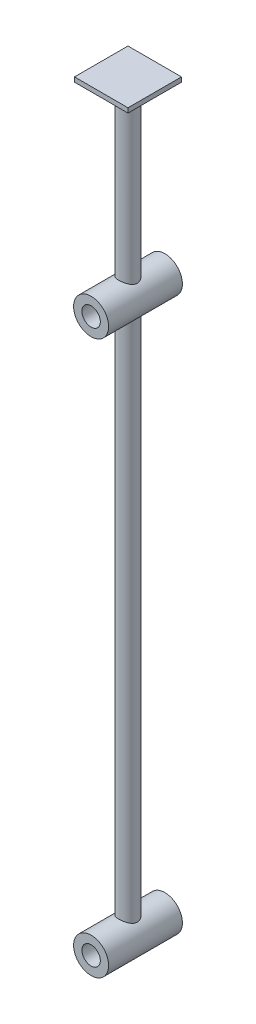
ISO-10303-21;
HEADER;
FILE_DESCRIPTION(('STEP AP214'),'2;1');
FILE_NAME('part.step','',(''),(''),'','','');
FILE_SCHEMA(('AUTOMOTIVE_DESIGN { 1 0 10303 214 1 1 1 1 }'));
ENDSEC;
DATA;
#1=APPLICATION_CONTEXT('core data for automotive mechanical design processes');
#2=APPLICATION_PROTOCOL_DEFINITION('international standard','automotive_design',2000,#1);
#3=PRODUCT_CONTEXT('',#1,'mechanical');
#4=PRODUCT('Part','Part','',(#3));
#5=PRODUCT_RELATED_PRODUCT_CATEGORY('part','',(#4));
#6=PRODUCT_DEFINITION_FORMATION('','',#4);
#7=PRODUCT_DEFINITION_CONTEXT('part definition',#1,'design');
#8=PRODUCT_DEFINITION('design','',#6,#7);
#9=PRODUCT_DEFINITION_SHAPE('','',#8);
#10=(LENGTH_UNIT() NAMED_UNIT(*) SI_UNIT(.MILLI.,.METRE.));
#11=(NAMED_UNIT(*) PLANE_ANGLE_UNIT() SI_UNIT($,.RADIAN.));
#12=(NAMED_UNIT(*) SI_UNIT($,.STERADIAN.) SOLID_ANGLE_UNIT());
#13=UNCERTAINTY_MEASURE_WITH_UNIT(LENGTH_MEASURE(1.E-05),#10,'distance_accuracy_value','');
#14=(GEOMETRIC_REPRESENTATION_CONTEXT(3) GLOBAL_UNCERTAINTY_ASSIGNED_CONTEXT((#13)) GLOBAL_UNIT_ASSIGNED_CONTEXT((#10,
#11,#12)) REPRESENTATION_CONTEXT('',''));
#15=CARTESIAN_POINT('',(0.,0.,0.));
#16=DIRECTION('',(0.,0.,1.));
#17=DIRECTION('',(1.,0.,0.));
#18=AXIS2_PLACEMENT_3D('',#15,#16,#17);
#19=CARTESIAN_POINT('',(0.,0.,40.));
#20=DIRECTION('',(0.,0.,-1.));
#21=DIRECTION('',(-1.,0.,0.));
#22=AXIS2_PLACEMENT_3D('',#19,#20,#21);
#23=CYLINDRICAL_SURFACE('',#22,19.);
#24=CARTESIAN_POINT('',(0.,0.,-40.));
#25=DIRECTION('',(0.,0.,1.));
#26=DIRECTION('',(1.,0.,0.));
#27=AXIS2_PLACEMENT_3D('',#24,#25,#26);
#28=CIRCLE('',#27,19.);
#29=CARTESIAN_POINT('',(19.,0.,-40.));
#30=VERTEX_POINT('',#29);
#31=EDGE_CURVE('E199',#30,#30,#28,.T.);
#32=ORIENTED_EDGE('',*,*,#31,.T.);
#33=EDGE_LOOP('',(#32));
#34=FACE_BOUND('',#33,.T.);
#35=CARTESIAN_POINT('',(0.,0.,40.));
#36=DIRECTION('',(0.,0.,1.));
#37=DIRECTION('',(1.,0.,0.));
#38=AXIS2_PLACEMENT_3D('',#35,#36,#37);
#39=CIRCLE('',#38,19.);
#40=CARTESIAN_POINT('',(19.,0.,40.));
#41=VERTEX_POINT('',#40);
#42=EDGE_CURVE('E203',#41,#41,#39,.T.);
#43=ORIENTED_EDGE('',*,*,#42,.F.);
#44=EDGE_LOOP('',(#43));
#45=FACE_BOUND('',#44,.T.);
#46=CARTESIAN_POINT('',(0.,19.,-10.));
#47=CARTESIAN_POINT('',(-0.261284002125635,19.0000005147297,-10.0000006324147));
#48=CARTESIAN_POINT('',(-0.522560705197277,18.9945987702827,-9.9897489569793));
#49=CARTESIAN_POINT('',(-1.04316816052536,18.9731308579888,-9.94886917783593));
#50=CARTESIAN_POINT('',(-1.30249817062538,18.957060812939,-9.91823366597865));
#51=CARTESIAN_POINT('',(-1.81751271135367,18.9146374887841,-9.8369057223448));
#52=CARTESIAN_POINT('',(-2.07319149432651,18.8882695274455,-9.78618465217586));
#53=CARTESIAN_POINT('',(-2.57867692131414,18.8259203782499,-9.66529653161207));
#54=CARTESIAN_POINT('',(-2.82848403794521,18.7899399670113,-9.59513105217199));
#55=CARTESIAN_POINT('',(-3.31961543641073,18.7094050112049,-9.43644465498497));
#56=CARTESIAN_POINT('',(-3.56096999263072,18.6648858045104,-9.34799927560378));
#57=CARTESIAN_POINT('',(-4.03485602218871,18.5682100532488,-9.15344464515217));
#58=CARTESIAN_POINT('',(-4.26738734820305,18.5160533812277,-9.04733509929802));
#59=CARTESIAN_POINT('',(-4.72235633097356,18.4052752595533,-8.81840050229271));
#60=CARTESIAN_POINT('',(-4.94479706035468,18.3466557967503,-8.69558058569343));
#61=CARTESIAN_POINT('',(-5.37873126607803,18.2241626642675,-8.43406514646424));
#62=CARTESIAN_POINT('',(-5.59022036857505,18.1602869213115,-8.29536335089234));
#63=CARTESIAN_POINT('',(-6.01460634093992,18.024353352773,-7.99353665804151));
#64=CARTESIAN_POINT('',(-6.22670849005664,17.9520335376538,-7.82941208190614));
#65=CARTESIAN_POINT('',(-6.63651342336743,17.804609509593,-7.48520583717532));
#66=CARTESIAN_POINT('',(-6.83421528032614,17.7295051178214,-7.305123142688));
#67=CARTESIAN_POINT('',(-7.21451054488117,17.5781895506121,-6.92980933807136));
#68=CARTESIAN_POINT('',(-7.39709330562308,17.5019776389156,-6.73456773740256));
#69=CARTESIAN_POINT('',(-7.74621354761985,17.3502856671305,-6.32989771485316));
#70=CARTESIAN_POINT('',(-7.91274787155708,17.2748057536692,-6.12046651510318));
#71=CARTESIAN_POINT('',(-8.24291049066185,17.1198877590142,-5.66915875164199));
#72=CARTESIAN_POINT('',(-8.40497498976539,17.0406912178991,-5.42605141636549));
#73=CARTESIAN_POINT('',(-8.70782467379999,16.8879410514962,-4.92537784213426));
#74=CARTESIAN_POINT('',(-8.84861889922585,16.8143850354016,-4.6678178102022));
#75=CARTESIAN_POINT('',(-9.10770883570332,16.6754685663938,-4.13958216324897));
#76=CARTESIAN_POINT('',(-9.22601190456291,16.6101054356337,-3.86891087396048));
#77=CARTESIAN_POINT('',(-9.43882340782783,16.4901048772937,-3.3160680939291));
#78=CARTESIAN_POINT('',(-9.53333475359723,16.4354661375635,-3.03389801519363));
#79=CARTESIAN_POINT('',(-9.69216515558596,16.342273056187,-2.47795243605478));
#80=CARTESIAN_POINT('',(-9.75799252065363,16.3029316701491,-2.20474068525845));
#81=CARTESIAN_POINT('',(-9.86658453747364,16.2374428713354,-1.65219790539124));
#82=CARTESIAN_POINT('',(-9.90935028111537,16.2112948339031,-1.3728671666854));
#83=CARTESIAN_POINT('',(-9.97107137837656,16.1734057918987,-0.810899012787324));
#84=CARTESIAN_POINT('',(-9.9900511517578,16.1616500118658,-0.528265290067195));
#85=CARTESIAN_POINT('',(-10.0039341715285,16.1530610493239,0.0378054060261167));
#86=CARTESIAN_POINT('',(-9.99884019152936,16.1562261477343,0.321242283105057));
#87=CARTESIAN_POINT('',(-9.96701770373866,16.1758715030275,0.847516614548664));
#88=CARTESIAN_POINT('',(-9.94333614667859,16.1904759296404,1.09061653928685));
#89=CARTESIAN_POINT('',(-9.8784085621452,16.230172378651,1.57367261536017));
#90=CARTESIAN_POINT('',(-9.83715681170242,16.2552678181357,1.81362771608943));
#91=CARTESIAN_POINT('',(-9.73759309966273,16.315104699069,2.28870892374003));
#92=CARTESIAN_POINT('',(-9.67928248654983,16.3498453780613,2.52383541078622));
#93=CARTESIAN_POINT('',(-9.54620984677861,16.4278977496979,2.98801042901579));
#94=CARTESIAN_POINT('',(-9.4714412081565,16.4712128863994,3.21705647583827));
#95=CARTESIAN_POINT('',(-9.30431496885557,16.5662050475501,3.67286425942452));
#96=CARTESIAN_POINT('',(-9.21160309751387,16.6180466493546,3.89946183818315));
#97=CARTESIAN_POINT('',(-9.01048616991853,16.7279495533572,4.34404850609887));
#98=CARTESIAN_POINT('',(-8.90207458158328,16.786013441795,4.56203396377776));
#99=CARTESIAN_POINT('',(-8.55432284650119,16.9673731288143,5.20181612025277));
#100=CARTESIAN_POINT('',(-8.29238326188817,17.0978858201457,5.60966156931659));
#101=CARTESIAN_POINT('',(-7.83826688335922,17.3088082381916,6.21592229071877));
#102=CARTESIAN_POINT('',(-7.66424721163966,17.3867412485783,6.42923355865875));
#103=CARTESIAN_POINT('',(-7.2993231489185,17.5430678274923,6.8407160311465));
#104=CARTESIAN_POINT('',(-7.1084231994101,17.6214612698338,7.0388911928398));
#105=CARTESIAN_POINT('',(-6.71045048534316,17.7768258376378,7.41928055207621));
#106=CARTESIAN_POINT('',(-6.5033627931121,17.8537955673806,7.60147968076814));
#107=CARTESIAN_POINT('',(-6.07417007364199,18.0043369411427,7.94862215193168));
#108=CARTESIAN_POINT('',(-5.85207093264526,18.0779098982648,8.11357219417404));
#109=CARTESIAN_POINT('',(-5.38074192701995,18.2239371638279,8.43406097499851));
#110=CARTESIAN_POINT('',(-5.13068725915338,18.2960889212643,8.58852809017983));
#111=CARTESIAN_POINT('',(-4.61627651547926,18.4326014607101,8.87562654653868));
#112=CARTESIAN_POINT('',(-4.35191965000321,18.4969618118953,9.00825668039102));
#113=CARTESIAN_POINT('',(-3.81082956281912,18.6159675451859,9.25015303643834));
#114=CARTESIAN_POINT('',(-3.53410511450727,18.6706196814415,9.35943551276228));
#115=CARTESIAN_POINT('',(-2.97021198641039,18.7685824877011,9.55336065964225));
#116=CARTESIAN_POINT('',(-2.68304466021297,18.811894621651,9.63800651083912));
#117=CARTESIAN_POINT('',(-2.12649785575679,18.882521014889,9.77510765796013));
#118=CARTESIAN_POINT('',(-1.85779198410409,18.9109115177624,9.8297481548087));
#119=CARTESIAN_POINT('',(-1.31585742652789,18.9563295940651,9.91684520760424));
#120=CARTESIAN_POINT('',(-1.04262900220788,18.9733578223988,9.9493030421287));
#121=CARTESIAN_POINT('',(-0.494073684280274,18.9955576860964,9.99157318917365));
#122=CARTESIAN_POINT('',(-0.21874782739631,19.0007348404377,10.0013960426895));
#123=CARTESIAN_POINT('',(0.331732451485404,18.9990971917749,9.9982848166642));
#124=CARTESIAN_POINT('',(0.606886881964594,18.9922830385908,9.9853519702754));
#125=CARTESIAN_POINT('',(1.13052507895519,18.9679853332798,9.93905468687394));
#126=CARTESIAN_POINT('',(1.37922572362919,18.9514930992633,9.90758769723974));
#127=CARTESIAN_POINT('',(1.87276574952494,18.9091005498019,9.82625509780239));
#128=CARTESIAN_POINT('',(2.11760541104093,18.8832009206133,9.77639083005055));
#129=CARTESIAN_POINT('',(2.60184593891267,18.8225914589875,9.65880350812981));
#130=CARTESIAN_POINT('',(2.84124652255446,18.7878811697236,9.59107952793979));
#131=CARTESIAN_POINT('',(3.31316753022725,18.7104279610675,9.43845508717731));
#132=CARTESIAN_POINT('',(3.54568765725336,18.6676846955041,9.35355388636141));
#133=CARTESIAN_POINT('',(4.00844380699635,18.5738933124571,9.16495407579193));
#134=CARTESIAN_POINT('',(4.23846905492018,18.5226606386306,9.06082997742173));
#135=CARTESIAN_POINT('',(4.68883852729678,18.4138142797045,8.83618595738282));
#136=CARTESIAN_POINT('',(4.90917927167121,18.3561983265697,8.71566020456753));
#137=CARTESIAN_POINT('',(5.55406751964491,18.1755666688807,8.3308323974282));
#138=CARTESIAN_POINT('',(5.96273573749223,18.0447135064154,8.04317505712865));
#139=CARTESIAN_POINT('',(6.77145924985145,17.7581098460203,7.37898633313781));
#140=CARTESIAN_POINT('',(7.16603086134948,17.6011898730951,6.99627261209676));
#141=CARTESIAN_POINT('',(7.70723704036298,17.3677103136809,6.37760161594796));
#142=CARTESIAN_POINT('',(7.87931390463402,17.290139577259,6.16375663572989));
#143=CARTESIAN_POINT('',(8.20577824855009,17.1376081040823,5.72194108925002));
#144=CARTESIAN_POINT('',(8.36016292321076,17.0626477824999,5.49396829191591));
#145=CARTESIAN_POINT('',(8.65941013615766,16.9128469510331,5.01005195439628));
#146=CARTESIAN_POINT('',(8.80304472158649,16.8383165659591,4.75325154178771));
#147=CARTESIAN_POINT('',(9.06779974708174,16.6972305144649,4.22633185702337));
#148=CARTESIAN_POINT('',(9.18893102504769,16.6306710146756,3.95621907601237));
#149=CARTESIAN_POINT('',(9.40731953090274,16.508119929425,3.40445109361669));
#150=CARTESIAN_POINT('',(9.50459784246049,16.4521190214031,3.12280634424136));
#151=CARTESIAN_POINT('',(9.67406007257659,16.353049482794,2.54985445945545));
#152=CARTESIAN_POINT('',(9.74624834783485,16.3099786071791,2.2585490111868));
#153=CARTESIAN_POINT('',(9.85856321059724,16.2423087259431,1.69774059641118));
#154=CARTESIAN_POINT('',(9.90113675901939,16.2163141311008,1.42889516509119));
#155=CARTESIAN_POINT('',(9.96424753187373,16.1776128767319,0.887677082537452));
#156=CARTESIAN_POINT('',(9.98478632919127,16.1649052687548,0.615304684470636));
#157=CARTESIAN_POINT('',(10.0034813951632,16.1533427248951,0.0696430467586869));
#158=CARTESIAN_POINT('',(10.0016494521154,16.1544804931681,-0.203645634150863));
#159=CARTESIAN_POINT('',(9.97566176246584,16.1705413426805,-0.748739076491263));
#160=CARTESIAN_POINT('',(9.95150735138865,16.1854635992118,-1.02054392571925));
#161=CARTESIAN_POINT('',(9.88536409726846,16.2259319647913,-1.52887206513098));
#162=CARTESIAN_POINT('',(9.84577155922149,16.2500434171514,-1.76582765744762));
#163=CARTESIAN_POINT('',(9.74992729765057,16.3077296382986,-2.23524548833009));
#164=CARTESIAN_POINT('',(9.6936701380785,16.3413074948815,-2.46770623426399));
#165=CARTESIAN_POINT('',(9.56510209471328,16.4168928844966,-2.92670680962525));
#166=CARTESIAN_POINT('',(9.49279294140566,16.4588995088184,-3.1532472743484));
#167=CARTESIAN_POINT('',(9.33278131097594,16.5501561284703,-3.59936363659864));
#168=CARTESIAN_POINT('',(9.24507274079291,16.5994089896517,-3.81893673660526));
#169=CARTESIAN_POINT('',(8.94751945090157,16.7629148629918,-4.49371460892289));
#170=CARTESIAN_POINT('',(8.71156310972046,16.8877835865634,-4.93512841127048));
#171=CARTESIAN_POINT('',(8.17907054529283,17.1519945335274,-5.77498340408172));
#172=CARTESIAN_POINT('',(7.88250172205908,17.2913445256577,-6.17340129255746));
#173=CARTESIAN_POINT('',(7.37386606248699,17.5119034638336,-6.7606006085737));
#174=CARTESIAN_POINT('',(7.18023518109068,17.5923703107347,-6.96590795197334));
#175=CARTESIAN_POINT('',(6.77605932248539,17.7519622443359,-7.3596581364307));
#176=CARTESIAN_POINT('',(6.5655194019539,17.8310877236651,-7.54810598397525));
#177=CARTESIAN_POINT('',(6.12833263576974,17.9860327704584,-7.907188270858));
#178=CARTESIAN_POINT('',(5.90167343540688,18.0618497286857,-8.07780879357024));
#179=CARTESIAN_POINT('',(5.43345572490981,18.2081771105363,-8.39989878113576));
#180=CARTESIAN_POINT('',(5.19189554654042,18.2786869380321,-8.55136609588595));
#181=CARTESIAN_POINT('',(4.69007445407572,18.4139103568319,-8.83675349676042));
#182=CARTESIAN_POINT('',(4.42953125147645,18.4784750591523,-8.97024902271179));
#183=CARTESIAN_POINT('',(3.89606361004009,18.5982625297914,-9.21448276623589));
#184=CARTESIAN_POINT('',(3.62314535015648,18.6534898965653,-9.3252321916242));
#185=CARTESIAN_POINT('',(3.06737047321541,18.7528865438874,-9.52249972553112));
#186=CARTESIAN_POINT('',(2.78453560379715,18.7970784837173,-9.60906753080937));
#187=CARTESIAN_POINT('',(2.21088063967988,18.8731460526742,-9.75703214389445));
#188=CARTESIAN_POINT('',(1.92006517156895,18.9050286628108,-9.81844322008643));
#189=CARTESIAN_POINT('',(1.3585010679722,18.9532815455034,-9.91101868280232));
#190=CARTESIAN_POINT('',(1.08820229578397,18.9707582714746,-9.9443461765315));
#191=CARTESIAN_POINT('',(0.545266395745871,18.9941173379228,-9.98883671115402));
#192=CARTESIAN_POINT('',(0.272629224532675,18.9999994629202,-9.99999934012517));
#193=CARTESIAN_POINT('',(0.,19.,-10.));
#194=B_SPLINE_CURVE_WITH_KNOTS('',3,(#46,#47,#48,#49,#50,#51,#52,#53,#54,#55,#56,#57,#58,#59,
#60,#61,#62,#63,#64,#65,#66,#67,#68,#69,#70,#71,#72,#73,#74,#75,#76,#77,#78,#79,#80,#81,#82,#83,
#84,#85,#86,#87,#88,#89,#90,#91,#92,#93,#94,#95,#96,#97,#98,#99,#100,#101,#102,#103,#104,#105,
#106,#107,#108,#109,#110,#111,#112,#113,#114,#115,#116,#117,#118,#119,#120,#121,#122,#123,#124,
#125,#126,#127,#128,#129,#130,#131,#132,#133,#134,#135,#136,#137,#138,#139,#140,#141,#142,#143,
#144,#145,#146,#147,#148,#149,#150,#151,#152,#153,#154,#155,#156,#157,#158,#159,#160,#161,#162,
#163,#164,#165,#166,#167,#168,#169,#170,#171,#172,#173,#174,#175,#176,#177,#178,#179,#180,#181,
#182,#183,#184,#185,#186,#187,#188,#189,#190,#191,#192,#193),.UNSPECIFIED.,.T.,.F.,(4,2,2,2,2,2,
2,2,2,2,2,2,2,2,2,2,2,2,2,2,2,2,2,2,2,2,2,2,2,2,2,2,2,2,2,2,2,2,2,2,2,2,2,2,2,2,2,2,2,2,2,2,2,2,
2,2,2,2,2,2,2,2,2,2,2,2,2,2,2,2,2,2,2,4),(0.,0.783584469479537,1.56745387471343,
2.35244498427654,3.13737269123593,3.91911945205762,4.70087926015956,5.48239939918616,
6.26422929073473,7.09665835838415,7.92914097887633,8.7622049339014,9.59543245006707,
10.5024590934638,11.4090991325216,12.3154420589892,13.221674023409,14.071734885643,
14.9217554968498,15.7709027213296,16.6199521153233,17.3531458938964,18.0865786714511,
18.8199534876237,19.553623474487,20.3036140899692,21.0539176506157,22.5538035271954,
23.4114231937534,24.2688178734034,25.1270127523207,25.9848730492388,26.8916087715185,
27.7983946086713,28.7045470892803,29.6105825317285,30.4364704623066,31.2623107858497,
32.087766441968,32.9131773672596,33.6659770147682,34.4187217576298,35.1715055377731,
35.9243217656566,36.6964057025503,37.4687648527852,39.0126504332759,40.7198458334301,
41.5748048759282,42.4298992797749,43.3393150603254,44.2482917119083,45.1564619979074,
46.0644745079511,46.8835924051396,47.7026518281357,48.5212796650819,49.3398585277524,
50.0633953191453,50.7871683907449,51.5108634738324,52.2348455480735,53.7760426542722,
55.318070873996,56.197603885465,57.0768748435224,57.9568271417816,58.836878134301,
59.7350141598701,60.6327065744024,61.5285402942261,62.4238652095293,63.2414585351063,
64.0590670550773),.UNSPECIFIED.);
#195=CARTESIAN_POINT('',(0.,19.,-10.));
#196=VERTEX_POINT('',#195);
#197=EDGE_CURVE('E11',#196,#196,#194,.T.);
#198=ORIENTED_EDGE('',*,*,#197,.F.);
#199=EDGE_LOOP('',(#198));
#200=FACE_BOUND('',#199,.T.);
#201=ADVANCED_FACE('F32',(#34,#45,#200),#23,.T.);
#202=CARTESIAN_POINT('',(0.,0.,40.));
#203=DIRECTION('',(0.,0.,-1.));
#204=DIRECTION('',(-1.,0.,0.));
#205=AXIS2_PLACEMENT_3D('',#202,#203,#204);
#206=CYLINDRICAL_SURFACE('',#205,10.);
#207=CARTESIAN_POINT('',(0.,0.,-40.));
#208=DIRECTION('',(0.,0.,1.));
#209=DIRECTION('',(1.,0.,0.));
#210=AXIS2_PLACEMENT_3D('',#207,#208,#209);
#211=CIRCLE('',#210,10.);
#212=CARTESIAN_POINT('',(10.,0.,-40.));
#213=VERTEX_POINT('',#212);
#214=EDGE_CURVE('E136',#213,#213,#211,.T.);
#215=ORIENTED_EDGE('',*,*,#214,.F.);
#216=EDGE_LOOP('',(#215));
#217=FACE_BOUND('',#216,.T.);
#218=CARTESIAN_POINT('',(0.,0.,40.));
#219=DIRECTION('',(0.,0.,1.));
#220=DIRECTION('',(1.,0.,0.));
#221=AXIS2_PLACEMENT_3D('',#218,#219,#220);
#222=CIRCLE('',#221,10.);
#223=CARTESIAN_POINT('',(10.,0.,40.));
#224=VERTEX_POINT('',#223);
#225=EDGE_CURVE('E345',#224,#224,#222,.T.);
#226=ORIENTED_EDGE('',*,*,#225,.T.);
#227=EDGE_LOOP('',(#226));
#228=FACE_BOUND('',#227,.T.);
#229=CARTESIAN_POINT('',(0.,0.,0.));
#230=DIRECTION('',(0.,0.707106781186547,-0.707106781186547));
#231=DIRECTION('',(0.,-0.707106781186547,-0.707106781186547));
#232=AXIS2_PLACEMENT_3D('',#229,#230,#231);
#233=ELLIPSE('',#232,14.1421356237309,10.);
#234=CARTESIAN_POINT('',(-10.,0.,0.));
#235=VERTEX_POINT('',#234);
#236=CARTESIAN_POINT('',(10.,0.,0.));
#237=VERTEX_POINT('',#236);
#238=EDGE_CURVE('E58',#235,#237,#233,.T.);
#239=ORIENTED_EDGE('',*,*,#238,.T.);
#240=CARTESIAN_POINT('',(0.,0.,0.));
#241=DIRECTION('',(0.,-0.707106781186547,-0.707106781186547));
#242=DIRECTION('',(0.,0.707106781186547,-0.707106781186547));
#243=AXIS2_PLACEMENT_3D('',#240,#241,#242);
#244=ELLIPSE('',#243,14.1421356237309,10.);
#245=EDGE_CURVE('E45',#237,#235,#244,.F.);
#246=ORIENTED_EDGE('',*,*,#245,.T.);
#247=EDGE_LOOP('',(#239,#246));
#248=FACE_BOUND('',#247,.T.);
#249=ADVANCED_FACE('F189',(#217,#228,#248),#206,.F.);
#250=CARTESIAN_POINT('',(0.,0.,40.));
#251=DIRECTION('',(0.,0.,1.));
#252=DIRECTION('',(1.,0.,0.));
#253=AXIS2_PLACEMENT_3D('',#250,#251,#252);
#254=PLANE('',#253);
#255=ORIENTED_EDGE('',*,*,#42,.T.);
#256=EDGE_LOOP('',(#255));
#257=FACE_BOUND('',#256,.T.);
#258=ORIENTED_EDGE('',*,*,#225,.F.);
#259=EDGE_LOOP('',(#258));
#260=FACE_BOUND('',#259,.T.);
#261=ADVANCED_FACE('F194',(#257,#260),#254,.T.);
#262=CARTESIAN_POINT('',(0.,0.,-40.));
#263=DIRECTION('',(0.,0.,1.));
#264=DIRECTION('',(1.,0.,0.));
#265=AXIS2_PLACEMENT_3D('',#262,#263,#264);
#266=PLANE('',#265);
#267=ORIENTED_EDGE('',*,*,#214,.T.);
#268=EDGE_LOOP('',(#267));
#269=FACE_BOUND('',#268,.T.);
#270=ORIENTED_EDGE('',*,*,#31,.F.);
#271=EDGE_LOOP('',(#270));
#272=FACE_BOUND('',#271,.T.);
#273=ADVANCED_FACE('F151',(#269,#272),#266,.F.);
#274=CARTESIAN_POINT('',(0.,800.,0.));
#275=DIRECTION('',(0.,-1.,0.));
#276=DIRECTION('',(0.,0.,-1.));
#277=AXIS2_PLACEMENT_3D('',#274,#275,#276);
#278=CYLINDRICAL_SURFACE('',#277,10.);
#279=ORIENTED_EDGE('',*,*,#245,.F.);
#280=CARTESIAN_POINT('',(0.,0.,0.));
#281=DIRECTION('',(0.,1.,0.));
#282=DIRECTION('',(0.,0.,1.));
#283=AXIS2_PLACEMENT_3D('',#280,#281,#282);
#284=CIRCLE('',#283,10.);
#285=EDGE_CURVE('E52',#237,#235,#284,.T.);
#286=ORIENTED_EDGE('',*,*,#285,.T.);
#287=EDGE_LOOP('',(#279,#286));
#288=FACE_BOUND('',#287,.T.);
#289=ADVANCED_FACE('F149',(#288),#278,.T.);
#290=CARTESIAN_POINT('',(0.,0.,0.));
#291=DIRECTION('',(0.,1.,0.));
#292=DIRECTION('',(0.,0.,1.));
#293=AXIS2_PLACEMENT_3D('',#290,#291,#292);
#294=PLANE('',#293);
#295=ORIENTED_EDGE('',*,*,#285,.F.);
#296=EDGE_CURVE('E104',#235,#237,#284,.T.);
#297=ORIENTED_EDGE('',*,*,#296,.F.);
#298=EDGE_LOOP('',(#295,#297));
#299=FACE_BOUND('',#298,.T.);
#300=ADVANCED_FACE('F147',(#299),#294,.F.);
#301=ORIENTED_EDGE('',*,*,#238,.F.);
#302=ORIENTED_EDGE('',*,*,#296,.T.);
#303=EDGE_LOOP('',(#301,#302));
#304=FACE_BOUND('',#303,.T.);
#305=ADVANCED_FACE('F141',(#304),#278,.T.);
#306=CARTESIAN_POINT('',(0.,581.,-10.));
#307=CARTESIAN_POINT('',(0.261284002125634,580.99999948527,-10.0000006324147));
#308=CARTESIAN_POINT('',(0.522560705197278,581.005401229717,-9.9897489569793));
#309=CARTESIAN_POINT('',(1.04316816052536,581.026869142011,-9.94886917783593));
#310=CARTESIAN_POINT('',(1.30249817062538,581.042939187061,-9.91823366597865));
#311=CARTESIAN_POINT('',(1.81751271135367,581.085362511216,-9.8369057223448));
#312=CARTESIAN_POINT('',(2.07319149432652,581.111730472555,-9.78618465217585));
#313=CARTESIAN_POINT('',(2.57867692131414,581.17407962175,-9.66529653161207));
#314=CARTESIAN_POINT('',(2.82848403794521,581.210060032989,-9.59513105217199));
#315=CARTESIAN_POINT('',(3.31961543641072,581.290594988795,-9.43644465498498));
#316=CARTESIAN_POINT('',(3.5609699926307,581.33511419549,-9.34799927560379));
#317=CARTESIAN_POINT('',(4.03485602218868,581.431789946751,-9.15344464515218));
#318=CARTESIAN_POINT('',(4.26738734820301,581.483946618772,-9.04733509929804));
#319=CARTESIAN_POINT('',(4.72235633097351,581.594724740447,-8.81840050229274));
#320=CARTESIAN_POINT('',(4.94479706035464,581.65334420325,-8.69558058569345));
#321=CARTESIAN_POINT('',(5.378731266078,581.775837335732,-8.43406514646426));
#322=CARTESIAN_POINT('',(5.59022036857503,581.839713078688,-8.29536335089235));
#323=CARTESIAN_POINT('',(6.0146063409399,581.975646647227,-7.99353665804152));
#324=CARTESIAN_POINT('',(6.22670849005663,582.047966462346,-7.82941208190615));
#325=CARTESIAN_POINT('',(6.63651342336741,582.195390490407,-7.48520583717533));
#326=CARTESIAN_POINT('',(6.83421528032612,582.270494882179,-7.30512314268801));
#327=CARTESIAN_POINT('',(7.21451054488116,582.421810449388,-6.92980933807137));
#328=CARTESIAN_POINT('',(7.39709330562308,582.498022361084,-6.73456773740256));
#329=CARTESIAN_POINT('',(7.74621354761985,582.649714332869,-6.32989771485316));
#330=CARTESIAN_POINT('',(7.91274787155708,582.725194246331,-6.12046651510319));
#331=CARTESIAN_POINT('',(8.24291049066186,582.880112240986,-5.66915875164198));
#332=CARTESIAN_POINT('',(8.40497498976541,582.959308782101,-5.42605141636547));
#333=CARTESIAN_POINT('',(8.70782467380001,583.112058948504,-4.92537784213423));
#334=CARTESIAN_POINT('',(8.84861889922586,583.185614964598,-4.66781781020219));
#335=CARTESIAN_POINT('',(9.10770883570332,583.324531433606,-4.13958216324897));
#336=CARTESIAN_POINT('',(9.22601190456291,583.389894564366,-3.86891087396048));
#337=CARTESIAN_POINT('',(9.43882340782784,583.509895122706,-3.3160680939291));
#338=CARTESIAN_POINT('',(9.53333475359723,583.564533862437,-3.03389801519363));
#339=CARTESIAN_POINT('',(9.69216515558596,583.657726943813,-2.47795243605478));
#340=CARTESIAN_POINT('',(9.75799252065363,583.697068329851,-2.20474068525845));
#341=CARTESIAN_POINT('',(9.86658453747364,583.762557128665,-1.65219790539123));
#342=CARTESIAN_POINT('',(9.90935028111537,583.788705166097,-1.3728671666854));
#343=CARTESIAN_POINT('',(9.97107137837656,583.826594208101,-0.810899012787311));
#344=CARTESIAN_POINT('',(9.9900511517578,583.838349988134,-0.528265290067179));
#345=CARTESIAN_POINT('',(10.0039341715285,583.846938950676,0.037805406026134));
#346=CARTESIAN_POINT('',(9.99884019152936,583.843773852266,0.321242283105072));
#347=CARTESIAN_POINT('',(9.96701770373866,583.824128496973,0.847516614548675));
#348=CARTESIAN_POINT('',(9.94333614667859,583.80952407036,1.09061653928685));
#349=CARTESIAN_POINT('',(9.8784085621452,583.769827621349,1.57367261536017));
#350=CARTESIAN_POINT('',(9.83715681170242,583.744732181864,1.81362771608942));
#351=CARTESIAN_POINT('',(9.73759309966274,583.684895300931,2.28870892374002));
#352=CARTESIAN_POINT('',(9.67928248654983,583.650154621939,2.52383541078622));
#353=CARTESIAN_POINT('',(9.54620984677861,583.572102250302,2.98801042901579));
#354=CARTESIAN_POINT('',(9.4714412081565,583.528787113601,3.21705647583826));
#355=CARTESIAN_POINT('',(9.30431496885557,583.43379495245,3.67286425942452));
#356=CARTESIAN_POINT('',(9.21160309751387,583.381953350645,3.89946183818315));
#357=CARTESIAN_POINT('',(9.01048616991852,583.272050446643,4.34404850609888));
#358=CARTESIAN_POINT('',(8.90207458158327,583.213986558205,4.56203396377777));
#359=CARTESIAN_POINT('',(8.55432284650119,583.032626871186,5.20181612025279));
#360=CARTESIAN_POINT('',(8.29238326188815,582.902114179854,5.60966156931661));
#361=CARTESIAN_POINT('',(7.8382668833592,582.691191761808,6.21592229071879));
#362=CARTESIAN_POINT('',(7.66424721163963,582.613258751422,6.42923355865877));
#363=CARTESIAN_POINT('',(7.29932314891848,582.456932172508,6.84071603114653));
#364=CARTESIAN_POINT('',(7.10842319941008,582.378538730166,7.03889119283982));
#365=CARTESIAN_POINT('',(6.71045048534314,582.223174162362,7.41928055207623));
#366=CARTESIAN_POINT('',(6.50336279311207,582.146204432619,7.60147968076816));
#367=CARTESIAN_POINT('',(6.07417007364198,581.995663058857,7.94862215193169));
#368=CARTESIAN_POINT('',(5.85207093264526,581.922090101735,8.11357219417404));
#369=CARTESIAN_POINT('',(5.38074192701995,581.776062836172,8.43406097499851));
#370=CARTESIAN_POINT('',(5.13068725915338,581.703911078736,8.58852809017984));
#371=CARTESIAN_POINT('',(4.61627651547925,581.56739853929,8.87562654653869));
#372=CARTESIAN_POINT('',(4.35191965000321,581.503038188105,9.00825668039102));
#373=CARTESIAN_POINT('',(3.81082956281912,581.384032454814,9.25015303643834));
#374=CARTESIAN_POINT('',(3.53410511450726,581.329380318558,9.35943551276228));
#375=CARTESIAN_POINT('',(2.97021198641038,581.231417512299,9.55336065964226));
#376=CARTESIAN_POINT('',(2.68304466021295,581.188105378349,9.63800651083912));
#377=CARTESIAN_POINT('',(2.12649785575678,581.117478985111,9.77510765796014));
#378=CARTESIAN_POINT('',(1.85779198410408,581.089088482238,9.8297481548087));
#379=CARTESIAN_POINT('',(1.31585742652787,581.043670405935,9.91684520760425));
#380=CARTESIAN_POINT('',(1.04262900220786,581.026642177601,9.9493030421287));
#381=CARTESIAN_POINT('',(0.494073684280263,581.004442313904,9.99157318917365));
#382=CARTESIAN_POINT('',(0.218747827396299,580.999265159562,10.0013960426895));
#383=CARTESIAN_POINT('',(-0.331732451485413,581.000902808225,9.9982848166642));
#384=CARTESIAN_POINT('',(-0.606886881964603,581.007716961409,9.9853519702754));
#385=CARTESIAN_POINT('',(-1.13052507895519,581.03201466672,9.93905468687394));
#386=CARTESIAN_POINT('',(-1.37922572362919,581.048506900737,9.90758769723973));
#387=CARTESIAN_POINT('',(-1.87276574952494,581.090899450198,9.82625509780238));
#388=CARTESIAN_POINT('',(-2.11760541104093,581.116799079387,9.77639083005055));
#389=CARTESIAN_POINT('',(-2.60184593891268,581.177408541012,9.65880350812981));
#390=CARTESIAN_POINT('',(-2.84124652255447,581.212118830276,9.59107952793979));
#391=CARTESIAN_POINT('',(-3.31316753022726,581.289572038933,9.4384550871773));
#392=CARTESIAN_POINT('',(-3.54568765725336,581.332315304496,9.35355388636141));
#393=CARTESIAN_POINT('',(-4.00844380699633,581.426106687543,9.16495407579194));
#394=CARTESIAN_POINT('',(-4.23846905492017,581.477339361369,9.06082997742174));
#395=CARTESIAN_POINT('',(-4.68883852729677,581.586185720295,8.83618595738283));
#396=CARTESIAN_POINT('',(-4.9091792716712,581.64380167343,8.71566020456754));
#397=CARTESIAN_POINT('',(-5.5540675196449,581.824433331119,8.33083239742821));
#398=CARTESIAN_POINT('',(-5.96273573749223,581.955286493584,8.04317505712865));
#399=CARTESIAN_POINT('',(-6.77145924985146,582.24189015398,7.3789863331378));
#400=CARTESIAN_POINT('',(-7.16603086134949,582.398810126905,6.99627261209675));
#401=CARTESIAN_POINT('',(-7.70723704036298,582.632289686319,6.37760161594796));
#402=CARTESIAN_POINT('',(-7.87931390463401,582.709860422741,6.1637566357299));
#403=CARTESIAN_POINT('',(-8.20577824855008,582.862391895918,5.72194108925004));
#404=CARTESIAN_POINT('',(-8.36016292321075,582.9373522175,5.49396829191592));
#405=CARTESIAN_POINT('',(-8.65941013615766,583.087153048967,5.01005195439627));
#406=CARTESIAN_POINT('',(-8.80304472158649,583.161683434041,4.7532515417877));
#407=CARTESIAN_POINT('',(-9.06779974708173,583.302769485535,4.22633185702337));
#408=CARTESIAN_POINT('',(-9.18893102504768,583.369328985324,3.95621907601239));
#409=CARTESIAN_POINT('',(-9.40731953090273,583.491880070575,3.40445109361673));
#410=CARTESIAN_POINT('',(-9.50459784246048,583.547880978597,3.12280634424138));
#411=CARTESIAN_POINT('',(-9.67406007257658,583.646950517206,2.54985445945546));
#412=CARTESIAN_POINT('',(-9.74624834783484,583.690021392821,2.25854901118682));
#413=CARTESIAN_POINT('',(-9.85856321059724,583.757691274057,1.69774059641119));
#414=CARTESIAN_POINT('',(-9.90113675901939,583.783685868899,1.4288951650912));
#415=CARTESIAN_POINT('',(-9.96424753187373,583.822387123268,0.887677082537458));
#416=CARTESIAN_POINT('',(-9.98478632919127,583.835094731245,0.615304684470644));
#417=CARTESIAN_POINT('',(-10.0034813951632,583.846657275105,0.0696430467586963));
#418=CARTESIAN_POINT('',(-10.0016494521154,583.845519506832,-0.203645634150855));
#419=CARTESIAN_POINT('',(-9.97566176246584,583.829458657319,-0.748739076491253));
#420=CARTESIAN_POINT('',(-9.95150735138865,583.814536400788,-1.02054392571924));
#421=CARTESIAN_POINT('',(-9.88536409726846,583.774068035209,-1.52887206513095));
#422=CARTESIAN_POINT('',(-9.8457715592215,583.749956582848,-1.76582765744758));
#423=CARTESIAN_POINT('',(-9.74992729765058,583.692270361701,-2.23524548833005));
#424=CARTESIAN_POINT('',(-9.69367013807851,583.658692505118,-2.46770623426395));
#425=CARTESIAN_POINT('',(-9.5651020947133,583.583107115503,-2.92670680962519));
#426=CARTESIAN_POINT('',(-9.49279294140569,583.541100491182,-3.15324727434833));
#427=CARTESIAN_POINT('',(-9.33278131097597,583.44984387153,-3.59936363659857));
#428=CARTESIAN_POINT('',(-9.24507274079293,583.400591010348,-3.81893673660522));
#429=CARTESIAN_POINT('',(-8.94751945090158,583.237085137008,-4.49371460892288));
#430=CARTESIAN_POINT('',(-8.71156310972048,583.112216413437,-4.93512841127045));
#431=CARTESIAN_POINT('',(-8.17907054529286,582.848005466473,-5.77498340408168));
#432=CARTESIAN_POINT('',(-7.88250172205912,582.708655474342,-6.17340129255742));
#433=CARTESIAN_POINT('',(-7.37386606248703,582.488096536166,-6.76060060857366));
#434=CARTESIAN_POINT('',(-7.18023518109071,582.407629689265,-6.96590795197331));
#435=CARTESIAN_POINT('',(-6.77605932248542,582.248037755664,-7.35965813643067));
#436=CARTESIAN_POINT('',(-6.56551940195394,582.168912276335,-7.54810598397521));
#437=CARTESIAN_POINT('',(-6.12833263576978,582.013967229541,-7.90718827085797));
#438=CARTESIAN_POINT('',(-5.90167343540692,581.938150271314,-8.07780879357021));
#439=CARTESIAN_POINT('',(-5.43345572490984,581.791822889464,-8.39989878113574));
#440=CARTESIAN_POINT('',(-5.19189554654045,581.721313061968,-8.55136609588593));
#441=CARTESIAN_POINT('',(-4.69007445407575,581.586089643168,-8.8367534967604));
#442=CARTESIAN_POINT('',(-4.42953125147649,581.521524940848,-8.97024902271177));
#443=CARTESIAN_POINT('',(-3.89606361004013,581.401737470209,-9.21448276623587));
#444=CARTESIAN_POINT('',(-3.62314535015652,581.346510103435,-9.32523219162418));
#445=CARTESIAN_POINT('',(-3.06737047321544,581.247113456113,-9.52249972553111));
#446=CARTESIAN_POINT('',(-2.78453560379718,581.202921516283,-9.60906753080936));
#447=CARTESIAN_POINT('',(-2.2108806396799,581.126853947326,-9.75703214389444));
#448=CARTESIAN_POINT('',(-1.92006517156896,581.094971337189,-9.81844322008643));
#449=CARTESIAN_POINT('',(-1.35850106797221,581.046718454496,-9.91101868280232));
#450=CARTESIAN_POINT('',(-1.08820229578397,581.029241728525,-9.9443461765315));
#451=CARTESIAN_POINT('',(-0.545266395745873,581.005882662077,-9.98883671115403));
#452=CARTESIAN_POINT('',(-0.272629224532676,581.00000053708,-9.99999934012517));
#453=CARTESIAN_POINT('',(0.,581.,-10.));
#454=B_SPLINE_CURVE_WITH_KNOTS('',3,(#306,#307,#308,#309,#310,#311,#312,#313,#314,#315,#316,
#317,#318,#319,#320,#321,#322,#323,#324,#325,#326,#327,#328,#329,#330,#331,#332,#333,#334,#335,
#336,#337,#338,#339,#340,#341,#342,#343,#344,#345,#346,#347,#348,#349,#350,#351,#352,#353,#354,
#355,#356,#357,#358,#359,#360,#361,#362,#363,#364,#365,#366,#367,#368,#369,#370,#371,#372,#373,
#374,#375,#376,#377,#378,#379,#380,#381,#382,#383,#384,#385,#386,#387,#388,#389,#390,#391,#392,
#393,#394,#395,#396,#397,#398,#399,#400,#401,#402,#403,#404,#405,#406,#407,#408,#409,#410,#411,
#412,#413,#414,#415,#416,#417,#418,#419,#420,#421,#422,#423,#424,#425,#426,#427,#428,#429,#430,
#431,#432,#433,#434,#435,#436,#437,#438,#439,#440,#441,#442,#443,#444,#445,#446,#447,#448,#449,
#450,#451,#452,#453),.UNSPECIFIED.,.T.,.F.,(4,2,2,2,2,2,2,2,2,2,2,2,2,2,2,2,2,2,2,2,2,2,2,2,2,2,
2,2,2,2,2,2,2,2,2,2,2,2,2,2,2,2,2,2,2,2,2,2,2,2,2,2,2,2,2,2,2,2,2,2,2,2,2,2,2,2,2,2,2,2,2,2,2,
4),(0.,0.783584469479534,1.56745387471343,2.35244498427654,3.13737269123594,3.9191194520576,
4.7008792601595,5.48239939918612,6.26422929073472,7.09665835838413,7.92914097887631,
8.76220493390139,9.59543245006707,10.5024590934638,11.4090991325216,12.3154420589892,
13.221674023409,14.0717348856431,14.9217554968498,15.7709027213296,16.6199521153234,
17.3531458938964,18.0865786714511,18.8199534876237,19.553623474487,20.3036140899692,
21.0539176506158,22.5538035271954,23.4114231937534,24.2688178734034,25.1270127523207,
25.9848730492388,26.8916087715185,27.7983946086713,28.7045470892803,29.6105825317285,
30.4364704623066,31.2623107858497,32.087766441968,32.9131773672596,33.6659770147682,
34.4187217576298,35.1715055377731,35.9243217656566,36.6964057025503,37.4687648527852,
39.0126504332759,40.7198458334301,41.5748048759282,42.4298992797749,43.3393150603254,
44.2482917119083,45.1564619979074,46.0644745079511,46.8835924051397,47.7026518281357,
48.5212796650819,49.3398585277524,50.0633953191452,50.7871683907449,51.5108634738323,
52.2348455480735,53.7760426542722,55.318070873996,56.197603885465,57.0768748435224,
57.9568271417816,58.836878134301,59.7350141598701,60.6327065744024,61.5285402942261,
62.4238652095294,63.2414585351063,64.0590670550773),.UNSPECIFIED.);
#455=CARTESIAN_POINT('',(0.,581.,-10.));
#456=VERTEX_POINT('',#455);
#457=EDGE_CURVE('E113',#456,#456,#454,.T.);
#458=ORIENTED_EDGE('',*,*,#457,.T.);
#459=EDGE_LOOP('',(#458));
#460=FACE_BOUND('',#459,.T.);
#461=ORIENTED_EDGE('',*,*,#197,.T.);
#462=EDGE_LOOP('',(#461));
#463=FACE_BOUND('',#462,.T.);
#464=ADVANCED_FACE('F146',(#460,#463),#278,.T.);
#465=CARTESIAN_POINT('',(0.,600.,-93.7401153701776));
#466=DIRECTION('',(0.,0.,1.));
#467=DIRECTION('',(1.,0.,0.));
#468=AXIS2_PLACEMENT_3D('',#465,#466,#467);
#469=CYLINDRICAL_SURFACE('',#468,19.);
#470=ORIENTED_EDGE('',*,*,#457,.F.);
#471=EDGE_LOOP('',(#470));
#472=FACE_BOUND('',#471,.T.);
#473=CARTESIAN_POINT('',(0.,600.,-40.));
#474=DIRECTION('',(0.,0.,1.));
#475=DIRECTION('',(1.,0.,0.));
#476=AXIS2_PLACEMENT_3D('',#473,#474,#475);
#477=CIRCLE('',#476,19.);
#478=CARTESIAN_POINT('',(19.,600.,-40.));
#479=VERTEX_POINT('',#478);
#480=EDGE_CURVE('E115',#479,#479,#477,.F.);
#481=ORIENTED_EDGE('',*,*,#480,.F.);
#482=EDGE_LOOP('',(#481));
#483=FACE_BOUND('',#482,.T.);
#484=CARTESIAN_POINT('',(0.,600.,40.));
#485=DIRECTION('',(0.,0.,1.));
#486=DIRECTION('',(1.,0.,0.));
#487=AXIS2_PLACEMENT_3D('',#484,#485,#486);
#488=CIRCLE('',#487,19.);
#489=CARTESIAN_POINT('',(19.,600.,40.));
#490=VERTEX_POINT('',#489);
#491=EDGE_CURVE('E240',#490,#490,#488,.T.);
#492=ORIENTED_EDGE('',*,*,#491,.F.);
#493=EDGE_LOOP('',(#492));
#494=FACE_BOUND('',#493,.T.);
#495=CARTESIAN_POINT('',(0.,619.,-10.));
#496=CARTESIAN_POINT('',(-0.261284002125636,619.00000051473,-10.0000006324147));
#497=CARTESIAN_POINT('',(-0.522560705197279,618.994598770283,-9.9897489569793));
#498=CARTESIAN_POINT('',(-1.04316816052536,618.973130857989,-9.94886917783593));
#499=CARTESIAN_POINT('',(-1.30249817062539,618.957060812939,-9.91823366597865));
#500=CARTESIAN_POINT('',(-1.81751271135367,618.914637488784,-9.8369057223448));
#501=CARTESIAN_POINT('',(-2.07319149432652,618.888269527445,-9.78618465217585));
#502=CARTESIAN_POINT('',(-2.57867692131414,618.82592037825,-9.66529653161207));
#503=CARTESIAN_POINT('',(-2.82848403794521,618.789939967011,-9.59513105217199));
#504=CARTESIAN_POINT('',(-3.31961543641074,618.709405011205,-9.43644465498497));
#505=CARTESIAN_POINT('',(-3.56096999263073,618.66488580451,-9.34799927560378));
#506=CARTESIAN_POINT('',(-4.03485602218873,618.568210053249,-9.15344464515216));
#507=CARTESIAN_POINT('',(-4.26738734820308,618.516053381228,-9.04733509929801));
#508=CARTESIAN_POINT('',(-4.72235633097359,618.405275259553,-8.8184005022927));
#509=CARTESIAN_POINT('',(-4.94479706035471,618.34665579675,-8.69558058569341));
#510=CARTESIAN_POINT('',(-5.37873126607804,618.224162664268,-8.43406514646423));
#511=CARTESIAN_POINT('',(-5.59022036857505,618.160286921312,-8.29536335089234));
#512=CARTESIAN_POINT('',(-6.0146063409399,618.024353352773,-7.99353665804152));
#513=CARTESIAN_POINT('',(-6.22670849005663,617.952033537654,-7.82941208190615));
#514=CARTESIAN_POINT('',(-6.63651342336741,617.804609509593,-7.48520583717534));
#515=CARTESIAN_POINT('',(-6.83421528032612,617.729505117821,-7.30512314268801));
#516=CARTESIAN_POINT('',(-7.21451054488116,617.578189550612,-6.92980933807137));
#517=CARTESIAN_POINT('',(-7.39709330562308,617.501977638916,-6.73456773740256));
#518=CARTESIAN_POINT('',(-7.74621354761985,617.350285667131,-6.32989771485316));
#519=CARTESIAN_POINT('',(-7.91274787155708,617.274805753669,-6.12046651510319));
#520=CARTESIAN_POINT('',(-8.24291049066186,617.119887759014,-5.66915875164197));
#521=CARTESIAN_POINT('',(-8.40497498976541,617.040691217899,-5.42605141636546));
#522=CARTESIAN_POINT('',(-8.70782467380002,616.887941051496,-4.92537784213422));
#523=CARTESIAN_POINT('',(-8.84861889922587,616.814385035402,-4.66781781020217));
#524=CARTESIAN_POINT('',(-9.10770883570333,616.675468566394,-4.13958216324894));
#525=CARTESIAN_POINT('',(-9.22601190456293,616.610105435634,-3.86891087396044));
#526=CARTESIAN_POINT('',(-9.43882340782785,616.490104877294,-3.31606809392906));
#527=CARTESIAN_POINT('',(-9.53333475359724,616.435466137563,-3.03389801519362));
#528=CARTESIAN_POINT('',(-9.69216515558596,616.342273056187,-2.47795243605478));
#529=CARTESIAN_POINT('',(-9.75799252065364,616.302931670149,-2.20474068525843));
#530=CARTESIAN_POINT('',(-9.86658453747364,616.237442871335,-1.65219790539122));
#531=CARTESIAN_POINT('',(-9.90935028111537,616.211294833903,-1.37286716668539));
#532=CARTESIAN_POINT('',(-9.97107137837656,616.173405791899,-0.810899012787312));
#533=CARTESIAN_POINT('',(-9.9900511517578,616.161650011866,-0.52826529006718));
#534=CARTESIAN_POINT('',(-10.0039341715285,616.153061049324,0.037805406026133));
#535=CARTESIAN_POINT('',(-9.99884019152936,616.156226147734,0.321242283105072));
#536=CARTESIAN_POINT('',(-9.96701770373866,616.175871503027,0.847516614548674));
#537=CARTESIAN_POINT('',(-9.94333614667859,616.19047592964,1.09061653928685));
#538=CARTESIAN_POINT('',(-9.8784085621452,616.230172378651,1.57367261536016));
#539=CARTESIAN_POINT('',(-9.83715681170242,616.255267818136,1.81362771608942));
#540=CARTESIAN_POINT('',(-9.73759309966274,616.315104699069,2.28870892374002));
#541=CARTESIAN_POINT('',(-9.67928248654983,616.349845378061,2.52383541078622));
#542=CARTESIAN_POINT('',(-9.54620984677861,616.427897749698,2.98801042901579));
#543=CARTESIAN_POINT('',(-9.4714412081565,616.471212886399,3.21705647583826));
#544=CARTESIAN_POINT('',(-9.30431496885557,616.56620504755,3.67286425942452));
#545=CARTESIAN_POINT('',(-9.21160309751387,616.618046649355,3.89946183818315));
#546=CARTESIAN_POINT('',(-9.01048616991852,616.727949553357,4.34404850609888));
#547=CARTESIAN_POINT('',(-8.90207458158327,616.786013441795,4.56203396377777));
#548=CARTESIAN_POINT('',(-8.55432284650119,616.967373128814,5.20181612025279));
#549=CARTESIAN_POINT('',(-8.29238326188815,617.097885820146,5.60966156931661));
#550=CARTESIAN_POINT('',(-7.8382668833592,617.308808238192,6.21592229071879));
#551=CARTESIAN_POINT('',(-7.66424721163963,617.386741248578,6.42923355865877));
#552=CARTESIAN_POINT('',(-7.29932314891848,617.543067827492,6.84071603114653));
#553=CARTESIAN_POINT('',(-7.10842319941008,617.621461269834,7.03889119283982));
#554=CARTESIAN_POINT('',(-6.71045048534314,617.776825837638,7.41928055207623));
#555=CARTESIAN_POINT('',(-6.50336279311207,617.853795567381,7.60147968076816));
#556=CARTESIAN_POINT('',(-6.07417007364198,618.004336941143,7.94862215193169));
#557=CARTESIAN_POINT('',(-5.85207093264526,618.077909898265,8.11357219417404));
#558=CARTESIAN_POINT('',(-5.38074192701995,618.223937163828,8.43406097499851));
#559=CARTESIAN_POINT('',(-5.13068725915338,618.296088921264,8.58852809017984));
#560=CARTESIAN_POINT('',(-4.61627651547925,618.43260146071,8.87562654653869));
#561=CARTESIAN_POINT('',(-4.35191965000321,618.496961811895,9.00825668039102));
#562=CARTESIAN_POINT('',(-3.81082956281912,618.615967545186,9.25015303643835));
#563=CARTESIAN_POINT('',(-3.53410511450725,618.670619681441,9.35943551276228));
#564=CARTESIAN_POINT('',(-2.97021198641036,618.768582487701,9.55336065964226));
#565=CARTESIAN_POINT('',(-2.68304466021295,618.811894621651,9.63800651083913));
#566=CARTESIAN_POINT('',(-2.12649785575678,618.882521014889,9.77510765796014));
#567=CARTESIAN_POINT('',(-1.85779198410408,618.910911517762,9.8297481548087));
#568=CARTESIAN_POINT('',(-1.31585742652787,618.956329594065,9.91684520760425));
#569=CARTESIAN_POINT('',(-1.04262900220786,618.973357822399,9.9493030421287));
#570=CARTESIAN_POINT('',(-0.494073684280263,618.995557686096,9.99157318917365));
#571=CARTESIAN_POINT('',(-0.218747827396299,619.000734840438,10.0013960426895));
#572=CARTESIAN_POINT('',(0.331732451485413,618.999097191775,9.9982848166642));
#573=CARTESIAN_POINT('',(0.606886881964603,618.992283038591,9.9853519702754));
#574=CARTESIAN_POINT('',(1.13052507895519,618.96798533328,9.93905468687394));
#575=CARTESIAN_POINT('',(1.37922572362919,618.951493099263,9.90758769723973));
#576=CARTESIAN_POINT('',(1.87276574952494,618.909100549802,9.82625509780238));
#577=CARTESIAN_POINT('',(2.11760541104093,618.883200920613,9.77639083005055));
#578=CARTESIAN_POINT('',(2.60184593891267,618.822591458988,9.65880350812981));
#579=CARTESIAN_POINT('',(2.84124652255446,618.787881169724,9.59107952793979));
#580=CARTESIAN_POINT('',(3.31316753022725,618.710427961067,9.43845508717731));
#581=CARTESIAN_POINT('',(3.54568765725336,618.667684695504,9.35355388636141));
#582=CARTESIAN_POINT('',(4.00844380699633,618.573893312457,9.16495407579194));
#583=CARTESIAN_POINT('',(4.23846905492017,618.522660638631,9.06082997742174));
#584=CARTESIAN_POINT('',(4.68883852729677,618.413814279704,8.83618595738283));
#585=CARTESIAN_POINT('',(4.9091792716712,618.35619832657,8.71566020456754));
#586=CARTESIAN_POINT('',(5.5540675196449,618.175566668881,8.33083239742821));
#587=CARTESIAN_POINT('',(5.96273573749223,618.044713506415,8.04317505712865));
#588=CARTESIAN_POINT('',(6.77145924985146,617.75810984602,7.3789863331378));
#589=CARTESIAN_POINT('',(7.16603086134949,617.601189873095,6.99627261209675));
#590=CARTESIAN_POINT('',(7.70723704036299,617.367710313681,6.37760161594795));
#591=CARTESIAN_POINT('',(7.87931390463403,617.290139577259,6.16375663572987));
#592=CARTESIAN_POINT('',(8.2057782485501,617.137608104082,5.72194108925));
#593=CARTESIAN_POINT('',(8.36016292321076,617.0626477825,5.49396829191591));
#594=CARTESIAN_POINT('',(8.65941013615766,616.912846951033,5.01005195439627));
#595=CARTESIAN_POINT('',(8.8030447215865,616.838316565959,4.75325154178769));
#596=CARTESIAN_POINT('',(9.06779974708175,616.697230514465,4.22633185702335));
#597=CARTESIAN_POINT('',(9.18893102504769,616.630671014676,3.95621907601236));
#598=CARTESIAN_POINT('',(9.40731953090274,616.508119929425,3.40445109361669));
#599=CARTESIAN_POINT('',(9.50459784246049,616.452119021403,3.12280634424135));
#600=CARTESIAN_POINT('',(9.67406007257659,616.353049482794,2.54985445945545));
#601=CARTESIAN_POINT('',(9.74624834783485,616.309978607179,2.25854901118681));
#602=CARTESIAN_POINT('',(9.85856321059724,616.242308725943,1.69774059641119));
#603=CARTESIAN_POINT('',(9.90113675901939,616.216314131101,1.4288951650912));
#604=CARTESIAN_POINT('',(9.96424753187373,616.177612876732,0.887677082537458));
#605=CARTESIAN_POINT('',(9.98478632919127,616.164905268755,0.615304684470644));
#606=CARTESIAN_POINT('',(10.0034813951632,616.153342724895,0.0696430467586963));
#607=CARTESIAN_POINT('',(10.0016494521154,616.154480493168,-0.203645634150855));
#608=CARTESIAN_POINT('',(9.97566176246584,616.170541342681,-0.748739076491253));
#609=CARTESIAN_POINT('',(9.95150735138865,616.185463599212,-1.02054392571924));
#610=CARTESIAN_POINT('',(9.88536409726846,616.225931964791,-1.52887206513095));
#611=CARTESIAN_POINT('',(9.8457715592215,616.250043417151,-1.76582765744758));
#612=CARTESIAN_POINT('',(9.74992729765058,616.307729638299,-2.23524548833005));
#613=CARTESIAN_POINT('',(9.69367013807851,616.341307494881,-2.46770623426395));
#614=CARTESIAN_POINT('',(9.56510209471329,616.416892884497,-2.92670680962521));
#615=CARTESIAN_POINT('',(9.49279294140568,616.458899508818,-3.15324727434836));
#616=CARTESIAN_POINT('',(9.33278131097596,616.55015612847,-3.5993636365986));
#617=CARTESIAN_POINT('',(9.24507274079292,616.599408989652,-3.81893673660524));
#618=CARTESIAN_POINT('',(8.94751945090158,616.762914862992,-4.49371460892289));
#619=CARTESIAN_POINT('',(8.71156310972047,616.887783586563,-4.93512841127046));
#620=CARTESIAN_POINT('',(8.17907054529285,617.151994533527,-5.77498340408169));
#621=CARTESIAN_POINT('',(7.88250172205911,617.291344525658,-6.17340129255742));
#622=CARTESIAN_POINT('',(7.37386606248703,617.511903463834,-6.76060060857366));
#623=CARTESIAN_POINT('',(7.18023518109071,617.592370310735,-6.96590795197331));
#624=CARTESIAN_POINT('',(6.77605932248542,617.751962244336,-7.35965813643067));
#625=CARTESIAN_POINT('',(6.56551940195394,617.831087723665,-7.54810598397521));
#626=CARTESIAN_POINT('',(6.12833263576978,617.986032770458,-7.90718827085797));
#627=CARTESIAN_POINT('',(5.90167343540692,618.061849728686,-8.07780879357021));
#628=CARTESIAN_POINT('',(5.43345572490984,618.208177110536,-8.39989878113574));
#629=CARTESIAN_POINT('',(5.19189554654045,618.278686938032,-8.55136609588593));
#630=CARTESIAN_POINT('',(4.69007445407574,618.413910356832,-8.83675349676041));
#631=CARTESIAN_POINT('',(4.42953125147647,618.478475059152,-8.97024902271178));
#632=CARTESIAN_POINT('',(3.89606361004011,618.598262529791,-9.21448276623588));
#633=CARTESIAN_POINT('',(3.6231453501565,618.653489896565,-9.32523219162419));
#634=CARTESIAN_POINT('',(3.06737047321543,618.752886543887,-9.52249972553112));
#635=CARTESIAN_POINT('',(2.78453560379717,618.797078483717,-9.60906753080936));
#636=CARTESIAN_POINT('',(2.2108806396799,618.873146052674,-9.75703214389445));
#637=CARTESIAN_POINT('',(1.92006517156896,618.905028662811,-9.81844322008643));
#638=CARTESIAN_POINT('',(1.35850106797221,618.953281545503,-9.91101868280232));
#639=CARTESIAN_POINT('',(1.08820229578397,618.970758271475,-9.9443461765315));
#640=CARTESIAN_POINT('',(0.545266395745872,618.994117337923,-9.98883671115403));
#641=CARTESIAN_POINT('',(0.272629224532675,618.99999946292,-9.99999934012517));
#642=CARTESIAN_POINT('',(0.,619.,-10.));
#643=B_SPLINE_CURVE_WITH_KNOTS('',3,(#495,#496,#497,#498,#499,#500,#501,#502,#503,#504,#505,
#506,#507,#508,#509,#510,#511,#512,#513,#514,#515,#516,#517,#518,#519,#520,#521,#522,#523,#524,
#525,#526,#527,#528,#529,#530,#531,#532,#533,#534,#535,#536,#537,#538,#539,#540,#541,#542,#543,
#544,#545,#546,#547,#548,#549,#550,#551,#552,#553,#554,#555,#556,#557,#558,#559,#560,#561,#562,
#563,#564,#565,#566,#567,#568,#569,#570,#571,#572,#573,#574,#575,#576,#577,#578,#579,#580,#581,
#582,#583,#584,#585,#586,#587,#588,#589,#590,#591,#592,#593,#594,#595,#596,#597,#598,#599,#600,
#601,#602,#603,#604,#605,#606,#607,#608,#609,#610,#611,#612,#613,#614,#615,#616,#617,#618,#619,
#620,#621,#622,#623,#624,#625,#626,#627,#628,#629,#630,#631,#632,#633,#634,#635,#636,#637,#638,
#639,#640,#641,#642),.UNSPECIFIED.,.T.,.F.,(4,2,2,2,2,2,2,2,2,2,2,2,2,2,2,2,2,2,2,2,2,2,2,2,2,2,
2,2,2,2,2,2,2,2,2,2,2,2,2,2,2,2,2,2,2,2,2,2,2,2,2,2,2,2,2,2,2,2,2,2,2,2,2,2,2,2,2,2,2,2,2,2,2,
4),(0.,0.783584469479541,1.56745387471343,2.35244498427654,3.13737269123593,3.91911945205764,
4.70087926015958,5.48239939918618,6.26422929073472,7.09665835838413,7.92914097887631,
8.76220493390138,9.59543245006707,10.5024590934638,11.4090991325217,12.3154420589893,
13.221674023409,14.0717348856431,14.9217554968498,15.7709027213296,16.6199521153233,
17.3531458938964,18.0865786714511,18.8199534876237,19.553623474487,20.3036140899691,
21.0539176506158,22.5538035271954,23.4114231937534,24.2688178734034,25.1270127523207,
25.9848730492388,26.8916087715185,27.7983946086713,28.7045470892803,29.6105825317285,
30.4364704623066,31.2623107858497,32.087766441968,32.9131773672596,33.6659770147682,
34.4187217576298,35.1715055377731,35.9243217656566,36.6964057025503,37.4687648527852,
39.0126504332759,40.7198458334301,41.5748048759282,42.4298992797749,43.3393150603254,
44.2482917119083,45.1564619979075,46.0644745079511,46.8835924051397,47.7026518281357,
48.5212796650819,49.3398585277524,50.0633953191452,50.7871683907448,51.5108634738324,
52.2348455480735,53.7760426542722,55.318070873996,56.197603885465,57.0768748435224,
57.9568271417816,58.836878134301,59.7350141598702,60.6327065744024,61.5285402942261,
62.4238652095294,63.2414585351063,64.0590670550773),.UNSPECIFIED.);
#644=CARTESIAN_POINT('',(0.,619.,-10.));
#645=VERTEX_POINT('',#644);
#646=EDGE_CURVE('E36',#645,#645,#643,.T.);
#647=ORIENTED_EDGE('',*,*,#646,.F.);
#648=EDGE_LOOP('',(#647));
#649=FACE_BOUND('',#648,.T.);
#650=ADVANCED_FACE('F160',(#472,#483,#494,#649),#469,.T.);
#651=CARTESIAN_POINT('',(0.,600.,40.));
#652=DIRECTION('',(0.,0.,1.));
#653=DIRECTION('',(1.,0.,0.));
#654=AXIS2_PLACEMENT_3D('',#651,#652,#653);
#655=PLANE('',#654);
#656=CARTESIAN_POINT('',(0.,600.,40.));
#657=DIRECTION('',(0.,0.,1.));
#658=DIRECTION('',(1.,0.,0.));
#659=AXIS2_PLACEMENT_3D('',#656,#657,#658);
#660=CIRCLE('',#659,10.);
#661=CARTESIAN_POINT('',(10.,600.,40.));
#662=VERTEX_POINT('',#661);
#663=EDGE_CURVE('E244',#662,#662,#660,.T.);
#664=ORIENTED_EDGE('',*,*,#663,.F.);
#665=EDGE_LOOP('',(#664));
#666=FACE_BOUND('',#665,.T.);
#667=ORIENTED_EDGE('',*,*,#491,.T.);
#668=EDGE_LOOP('',(#667));
#669=FACE_BOUND('',#668,.T.);
#670=ADVANCED_FACE('F165',(#666,#669),#655,.T.);
#671=CARTESIAN_POINT('',(0.,0.,-40.));
#672=DIRECTION('',(0.,0.,1.));
#673=DIRECTION('',(1.,0.,0.));
#674=AXIS2_PLACEMENT_3D('',#671,#672,#673);
#675=PLANE('',#674);
#676=CARTESIAN_POINT('',(0.,600.,-40.));
#677=DIRECTION('',(0.,0.,1.));
#678=DIRECTION('',(1.,0.,0.));
#679=AXIS2_PLACEMENT_3D('',#676,#677,#678);
#680=CIRCLE('',#679,10.);
#681=CARTESIAN_POINT('',(10.,600.,-40.));
#682=VERTEX_POINT('',#681);
#683=EDGE_CURVE('E236',#682,#682,#680,.T.);
#684=ORIENTED_EDGE('',*,*,#683,.T.);
#685=EDGE_LOOP('',(#684));
#686=FACE_BOUND('',#685,.T.);
#687=ORIENTED_EDGE('',*,*,#480,.T.);
#688=EDGE_LOOP('',(#687));
#689=FACE_BOUND('',#688,.T.);
#690=ADVANCED_FACE('F174',(#686,#689),#675,.F.);
#691=CARTESIAN_POINT('',(29.,805.,29.));
#692=DIRECTION('',(0.,-1.,0.));
#693=DIRECTION('',(0.,0.,-1.));
#694=AXIS2_PLACEMENT_3D('',#691,#692,#693);
#695=PLANE('',#694);
#696=DIRECTION('',(0.,0.,-1.));
#697=VECTOR('',#696,1.);
#698=CARTESIAN_POINT('',(29.,805.,-29.));
#699=LINE('',#698,#697);
#700=CARTESIAN_POINT('',(29.,805.,29.));
#701=VERTEX_POINT('',#700);
#702=CARTESIAN_POINT('',(29.,805.,-29.));
#703=VERTEX_POINT('',#702);
#704=EDGE_CURVE('E121',#701,#703,#699,.T.);
#705=ORIENTED_EDGE('',*,*,#704,.T.);
#706=DIRECTION('',(-1.,0.,0.));
#707=VECTOR('',#706,1.);
#708=CARTESIAN_POINT('',(29.,805.,-29.));
#709=LINE('',#708,#707);
#710=CARTESIAN_POINT('',(-29.,805.,-29.));
#711=VERTEX_POINT('',#710);
#712=EDGE_CURVE('E100',#703,#711,#709,.T.);
#713=ORIENTED_EDGE('',*,*,#712,.T.);
#714=DIRECTION('',(0.,0.,1.));
#715=VECTOR('',#714,1.);
#716=CARTESIAN_POINT('',(-29.,805.,-29.));
#717=LINE('',#716,#715);
#718=CARTESIAN_POINT('',(-29.,805.,29.));
#719=VERTEX_POINT('',#718);
#720=EDGE_CURVE('E124',#711,#719,#717,.T.);
#721=ORIENTED_EDGE('',*,*,#720,.T.);
#722=DIRECTION('',(1.,0.,0.));
#723=VECTOR('',#722,1.);
#724=CARTESIAN_POINT('',(29.,805.,29.));
#725=LINE('',#724,#723);
#726=EDGE_CURVE('E126',#719,#701,#725,.T.);
#727=ORIENTED_EDGE('',*,*,#726,.T.);
#728=EDGE_LOOP('',(#705,#713,#721,#727));
#729=FACE_BOUND('',#728,.T.);
#730=ADVANCED_FACE('F171',(#729),#695,.F.);
#731=CARTESIAN_POINT('',(29.,805.,-29.));
#732=DIRECTION('',(0.,0.,1.));
#733=DIRECTION('',(1.,0.,0.));
#734=AXIS2_PLACEMENT_3D('',#731,#732,#733);
#735=PLANE('',#734);
#736=DIRECTION('',(-1.,0.,0.));
#737=VECTOR('',#736,1.);
#738=CARTESIAN_POINT('',(29.,800.,-29.));
#739=LINE('',#738,#737);
#740=CARTESIAN_POINT('',(29.,800.,-29.));
#741=VERTEX_POINT('',#740);
#742=CARTESIAN_POINT('',(-29.,800.,-29.));
#743=VERTEX_POINT('',#742);
#744=EDGE_CURVE('E85',#741,#743,#739,.T.);
#745=ORIENTED_EDGE('',*,*,#744,.T.);
#746=DIRECTION('',(0.,-1.,0.));
#747=VECTOR('',#746,1.);
#748=CARTESIAN_POINT('',(-29.,805.,-29.));
#749=LINE('',#748,#747);
#750=EDGE_CURVE('E105',#711,#743,#749,.T.);
#751=ORIENTED_EDGE('',*,*,#750,.F.);
#752=ORIENTED_EDGE('',*,*,#712,.F.);
#753=DIRECTION('',(0.,-1.,0.));
#754=VECTOR('',#753,1.);
#755=CARTESIAN_POINT('',(29.,805.,-29.));
#756=LINE('',#755,#754);
#757=EDGE_CURVE('E98',#703,#741,#756,.T.);
#758=ORIENTED_EDGE('',*,*,#757,.T.);
#759=EDGE_LOOP('',(#745,#751,#752,#758));
#760=FACE_BOUND('',#759,.T.);
#761=ADVANCED_FACE('F99',(#760),#735,.F.);
#762=CARTESIAN_POINT('',(-29.,805.,-29.));
#763=DIRECTION('',(1.,0.,0.));
#764=DIRECTION('',(0.,0.,-1.));
#765=AXIS2_PLACEMENT_3D('',#762,#763,#764);
#766=PLANE('',#765);
#767=DIRECTION('',(0.,0.,1.));
#768=VECTOR('',#767,1.);
#769=CARTESIAN_POINT('',(-29.,800.,-29.));
#770=LINE('',#769,#768);
#771=CARTESIAN_POINT('',(-29.,800.,29.));
#772=VERTEX_POINT('',#771);
#773=EDGE_CURVE('E92',#743,#772,#770,.T.);
#774=ORIENTED_EDGE('',*,*,#773,.T.);
#775=DIRECTION('',(0.,-1.,0.));
#776=VECTOR('',#775,1.);
#777=CARTESIAN_POINT('',(-29.,805.,29.));
#778=LINE('',#777,#776);
#779=EDGE_CURVE('E129',#719,#772,#778,.T.);
#780=ORIENTED_EDGE('',*,*,#779,.F.);
#781=ORIENTED_EDGE('',*,*,#720,.F.);
#782=ORIENTED_EDGE('',*,*,#750,.T.);
#783=EDGE_LOOP('',(#774,#780,#781,#782));
#784=FACE_BOUND('',#783,.T.);
#785=ADVANCED_FACE('F179',(#784),#766,.F.);
#786=CARTESIAN_POINT('',(29.,805.,29.));
#787=DIRECTION('',(0.,0.,-1.));
#788=DIRECTION('',(-1.,0.,0.));
#789=AXIS2_PLACEMENT_3D('',#786,#787,#788);
#790=PLANE('',#789);
#791=DIRECTION('',(1.,0.,0.));
#792=VECTOR('',#791,1.);
#793=CARTESIAN_POINT('',(29.,800.,29.));
#794=LINE('',#793,#792);
#795=CARTESIAN_POINT('',(29.,800.,29.));
#796=VERTEX_POINT('',#795);
#797=EDGE_CURVE('E119',#772,#796,#794,.T.);
#798=ORIENTED_EDGE('',*,*,#797,.T.);
#799=DIRECTION('',(0.,-1.,0.));
#800=VECTOR('',#799,1.);
#801=CARTESIAN_POINT('',(29.,805.,29.));
#802=LINE('',#801,#800);
#803=EDGE_CURVE('E110',#701,#796,#802,.T.);
#804=ORIENTED_EDGE('',*,*,#803,.F.);
#805=ORIENTED_EDGE('',*,*,#726,.F.);
#806=ORIENTED_EDGE('',*,*,#779,.T.);
#807=EDGE_LOOP('',(#798,#804,#805,#806));
#808=FACE_BOUND('',#807,.T.);
#809=ADVANCED_FACE('F176',(#808),#790,.F.);
#810=CARTESIAN_POINT('',(29.,805.,-29.));
#811=DIRECTION('',(-1.,0.,0.));
#812=DIRECTION('',(0.,0.,1.));
#813=AXIS2_PLACEMENT_3D('',#810,#811,#812);
#814=PLANE('',#813);
#815=DIRECTION('',(0.,0.,-1.));
#816=VECTOR('',#815,1.);
#817=CARTESIAN_POINT('',(29.,800.,-29.));
#818=LINE('',#817,#816);
#819=EDGE_CURVE('E91',#796,#741,#818,.T.);
#820=ORIENTED_EDGE('',*,*,#819,.T.);
#821=ORIENTED_EDGE('',*,*,#757,.F.);
#822=ORIENTED_EDGE('',*,*,#704,.F.);
#823=ORIENTED_EDGE('',*,*,#803,.T.);
#824=EDGE_LOOP('',(#820,#821,#822,#823));
#825=FACE_BOUND('',#824,.T.);
#826=ADVANCED_FACE('F108',(#825),#814,.F.);
#827=CARTESIAN_POINT('',(29.,800.,29.));
#828=DIRECTION('',(0.,-1.,0.));
#829=DIRECTION('',(0.,0.,-1.));
#830=AXIS2_PLACEMENT_3D('',#827,#828,#829);
#831=PLANE('',#830);
#832=ORIENTED_EDGE('',*,*,#819,.F.);
#833=ORIENTED_EDGE('',*,*,#797,.F.);
#834=ORIENTED_EDGE('',*,*,#773,.F.);
#835=ORIENTED_EDGE('',*,*,#744,.F.);
#836=EDGE_LOOP('',(#832,#833,#834,#835));
#837=FACE_BOUND('',#836,.T.);
#838=CARTESIAN_POINT('',(0.,800.,0.));
#839=DIRECTION('',(0.,1.,0.));
#840=DIRECTION('',(0.,0.,1.));
#841=AXIS2_PLACEMENT_3D('',#838,#839,#840);
#842=CIRCLE('',#841,10.);
#843=CARTESIAN_POINT('',(0.,800.,10.));
#844=VERTEX_POINT('',#843);
#845=EDGE_CURVE('E134',#844,#844,#842,.T.);
#846=ORIENTED_EDGE('',*,*,#845,.T.);
#847=EDGE_LOOP('',(#846));
#848=FACE_BOUND('',#847,.T.);
#849=ADVANCED_FACE('F87',(#837,#848),#831,.T.);
#850=ORIENTED_EDGE('',*,*,#646,.T.);
#851=EDGE_LOOP('',(#850));
#852=FACE_BOUND('',#851,.T.);
#853=ORIENTED_EDGE('',*,*,#845,.F.);
#854=EDGE_LOOP('',(#853));
#855=FACE_BOUND('',#854,.T.);
#856=ADVANCED_FACE('F148',(#852,#855),#278,.T.);
#857=CARTESIAN_POINT('',(0.,600.,-40.));
#858=DIRECTION('',(0.,0.,1.));
#859=DIRECTION('',(1.,0.,0.));
#860=AXIS2_PLACEMENT_3D('',#857,#858,#859);
#861=CYLINDRICAL_SURFACE('',#860,10.);
#862=ORIENTED_EDGE('',*,*,#683,.F.);
#863=EDGE_LOOP('',(#862));
#864=FACE_BOUND('',#863,.T.);
#865=ORIENTED_EDGE('',*,*,#663,.T.);
#866=EDGE_LOOP('',(#865));
#867=FACE_BOUND('',#866,.T.);
#868=ADVANCED_FACE('F213',(#864,#867),#861,.F.);
#869=CLOSED_SHELL('',(#201,#249,#261,#273,#289,#300,#305,#464,#650,#670,#690,#730,#761,#785,
#809,#826,#849,#856,#868));
#870=MANIFOLD_SOLID_BREP('B2',#869);
#871=ADVANCED_BREP_SHAPE_REPRESENTATION('',(#18,#870),#14);
#872=SHAPE_DEFINITION_REPRESENTATION(#9,#871);
ENDSEC;
END-ISO-10303-21;
